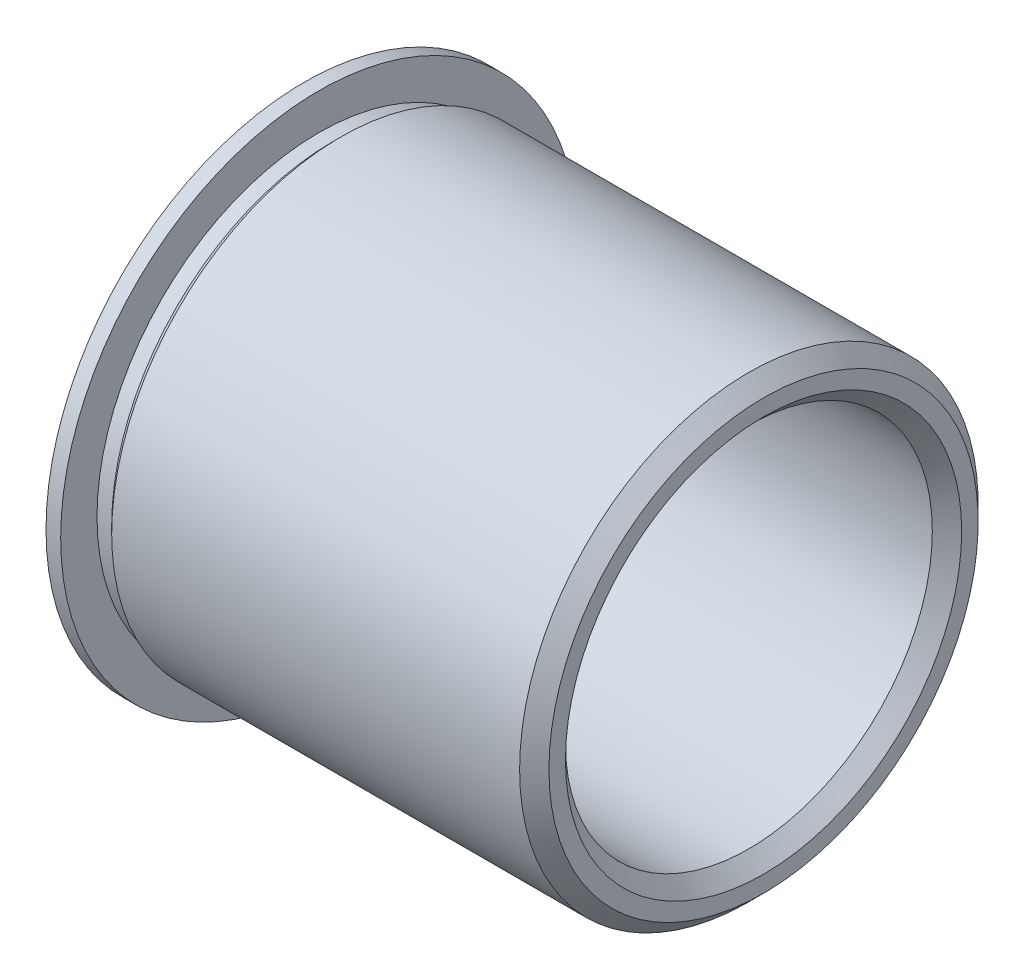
from build123d import *

# Parameters (mm, degrees)
SKETCH3_R          = 3.175
CUT_EXTRUDE1_DEPTH = 100.541833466
CHAMFER2_SIZE      = 0.254
CHAMFER3_SIZE      = 0.254


with BuildPart() as part:
    # Sketch2 → Revolve3 (revolve)
    with BuildSketch(Plane.XY, mode=Mode.PRIVATE) as revolve3_sk:
        Polygon((-53.041282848, 94.652687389), (-53.041282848, 99.123087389), (-52.787282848, 99.123087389), (-52.787282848, 98.494437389), (-52.533282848, 98.494437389), (-52.406282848, 98.621437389), (-45.345082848, 98.621437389), (-45.091082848, 98.367437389), (-45.091082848, 94.652687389), align=None)
    revolve(revolve3_sk.sketch.rotate(Axis((-53.041282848, 94.652687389, 0), (1, 0, 0)), 90), axis=Axis((-53.041282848, 94.652687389, 0), (1, 0, 0)))

    # Sketch3 → Cut-Extrude1 (cut, through all)
    with BuildSketch(Plane(origin=(-45.091082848, 0, 0), x_dir=(0, 0, -1), z_dir=(1, 0, 0))):
        with Locations((0, 94.652687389)):
            Circle(SKETCH3_R)
    extrude(amount=-CUT_EXTRUDE1_DEPTH, mode=Mode.SUBTRACT)

    # Chamfer2
    chamfer2_edges = [part.edges().sort_by_distance(p)[0] for p in [
        (-53.041282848, 94.652687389, 3.175),
    ]]
    chamfer(chamfer2_edges, length=CHAMFER2_SIZE)

    # Chamfer3
    chamfer3_edges = [part.edges().sort_by_distance(p)[0] for p in [
        (-45.091082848, 94.652687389, 3.175),
    ]]
    chamfer(chamfer3_edges, length=CHAMFER3_SIZE)


solid = part.part
